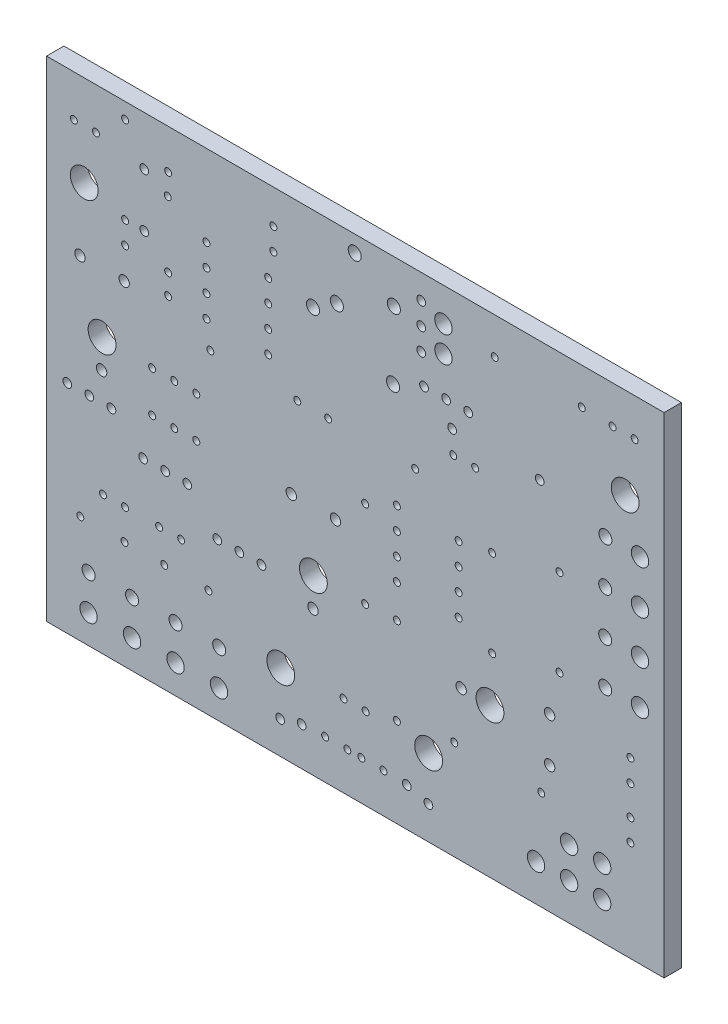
from build123d import *

# Parameters (mm, degrees)
ESQUISSE1_W             = 71
ESQUISSE1_H             = 56.3
EXTRUSION1_DEPTH        = 2
ESQUISSE3_R             = 0.50038
ESQUISSE3_R_2           = 0.39878
ESQUISSE3_R_3           = 1.6002
ESQUISSE3_R_4           = 0.59944
ESQUISSE3_R_5           = 0.7493
ESQUISSE3_R_6           = 1.00076
ENL_V_MAT_EXTRU_2_DEPTH = 91.634927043


with BuildPart() as part:
    # Esquisse1 → Extrusion1 (new body)
    with BuildSketch(Plane.XY):
        with Locations((35.5, -28.15)):
            Rectangle(ESQUISSE1_W, ESQUISSE1_H)
    extrude(amount=EXTRUSION1_DEPTH)

    # Esquisse3 → Enl_v. mat.-Extru.2 (cut, through all)
    with BuildSketch(Plane(origin=(0, 0, 0), x_dir=(-1, 0, 0), z_dir=(0, 0, -1))):
        with Locations((-46.632435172, -13.79982)):
            Circle(ESQUISSE3_R)
        with Locations((-56.695915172, -13.85062)):
            Circle(ESQUISSE3_R)
        with Locations((-26.081295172, -3.90144)):
            Circle(ESQUISSE3_R_2)
        with Locations((-26.081295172, -6.44144)):
            Circle(ESQUISSE3_R_2)
        with Locations((-65.080455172, -4.33324)):
            Circle(ESQUISSE3_R_2)
        with Locations((-67.620455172, -4.33324)):
            Circle(ESQUISSE3_R_2)
        with Locations((-5.682555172, -4.77012)):
            Circle(ESQUISSE3_R_2)
        with Locations((-3.142555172, -4.77012)):
            Circle(ESQUISSE3_R_2)
        with Locations((-4.331275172, -10.4521)):
            Circle(ESQUISSE3_R_3)
        with Locations((-25.481855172, -9.34974)):
            Circle(ESQUISSE3_R_2)
        with Locations((-40.282435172, -46.0502)):
            Circle(ESQUISSE3_R_2)
        with Locations((-40.282435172, -36.05022)):
            Circle(ESQUISSE3_R_2)
        with Locations((-36.632455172, -26.2509)):
            Circle(ESQUISSE3_R_2)
        with Locations((-36.632455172, -36.25088)):
            Circle(ESQUISSE3_R_2)
        with Locations((-61.532075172, -4.20116)):
            Circle(ESQUISSE3_R_2)
        with Locations((-51.532095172, -4.20116)):
            Circle(ESQUISSE3_R_2)
        with Locations((-46.881355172, -44.90212)):
            Circle(ESQUISSE3_R_2)
        with Locations((-56.881335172, -44.90212)):
            Circle(ESQUISSE3_R_2)
        with Locations((-28.832115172, -19.9009)):
            Circle(ESQUISSE3_R_2)
        with Locations((-18.832135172, -19.9009)):
            Circle(ESQUISSE3_R_2)
        with Locations((-58.981915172, -31.89986)):
            Circle(ESQUISSE3_R_2)
        with Locations((-58.981915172, -21.89988)):
            Circle(ESQUISSE3_R_2)
        with Locations((-51.232375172, -23.8506)):
            Circle(ESQUISSE3_R_2)
        with Locations((-51.232375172, -33.85058)):
            Circle(ESQUISSE3_R_2)
        with Locations((-32.383035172, -19.9009)):
            Circle(ESQUISSE3_R_2)
        with Locations((-42.383015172, -19.9009)):
            Circle(ESQUISSE3_R_2)
        with Locations((-43.932415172, -47.44974)):
            Circle(ESQUISSE3_R_3)
        with Locations((-13.983275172, -4.55168)):
            Circle(ESQUISSE3_R_2)
        with Locations((-13.983275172, -14.55166)):
            Circle(ESQUISSE3_R_2)
        with Locations((-36.683255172, -46.9011)):
            Circle(ESQUISSE3_R_2)
        with Locations((-34.143255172, -46.9011)):
            Circle(ESQUISSE3_R_2)
        with Locations((-38.735575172, -51.76774)):
            Circle(ESQUISSE3_R_2)
        with Locations((-66.533335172, -10.4521)):
            Circle(ESQUISSE3_R_3)
        with Locations((-11.232455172, -11.80084)):
            Circle(ESQUISSE3_R)
        with Locations((-57.841455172, -36.61156)):
            Circle(ESQUISSE3_R_4)
        with Locations((-57.841455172, -41.69156)):
            Circle(ESQUISSE3_R_4)
        with Locations((-47.671295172, -39.10076)):
            Circle(ESQUISSE3_R_4)
        with Locations((-3.843595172, -17.94002)):
            Circle(ESQUISSE3_R_4)
        with Locations((-8.923595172, -17.94002)):
            Circle(ESQUISSE3_R_4)
        with Locations((-6.332795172, -28.11018)):
            Circle(ESQUISSE3_R_4)
        with Locations((-19.632235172, -38.30066)):
            Circle(ESQUISSE3_R)
        with Locations((-22.172235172, -38.30066)):
            Circle(ESQUISSE3_R)
        with Locations((-24.712235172, -38.30066)):
            Circle(ESQUISSE3_R)
        with Locations((-11.232455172, -5.6515)):
            Circle(ESQUISSE3_R)
        with Locations((-50.983455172, -39.15156)):
            Circle(ESQUISSE3_R_3)
        with Locations((-6.383595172, -24.80056)):
            Circle(ESQUISSE3_R_3)
        with Locations((-64.254955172, -15.74038)):
            Circle(ESQUISSE3_R_5)
        with Locations((-64.232095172, -20.7518)):
            Circle(ESQUISSE3_R_5)
        with Locations((-64.232095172, -30.75178)):
            Circle(ESQUISSE3_R_5)
        with Locations((-64.232095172, -25.75052)):
            Circle(ESQUISSE3_R_5)
        with Locations((-26.932195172, -47.44974)):
            Circle(ESQUISSE3_R_3)
        with Locations((-68.232595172, -15.75054)):
            Circle(ESQUISSE3_R_6)
        with Locations((-68.232595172, -25.75052)):
            Circle(ESQUISSE3_R_6)
        with Locations((-68.232595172, -20.7518)):
            Circle(ESQUISSE3_R_6)
        with Locations((-68.232595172, -30.75178)):
            Circle(ESQUISSE3_R_6)
        with Locations((-60.081735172, -48.4505)):
            Circle(ESQUISSE3_R_6)
        with Locations((-63.881575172, -48.4505)):
            Circle(ESQUISSE3_R_6)
        with Locations((-32.032515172, -51.74996)):
            Circle(ESQUISSE3_R_2)
        with Locations((-34.582675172, -51.75758)):
            Circle(ESQUISSE3_R_2)
        with Locations((-36.195575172, -51.76774)):
            Circle(ESQUISSE3_R_2)
        with Locations((-13.983275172, -16.90116)):
            Circle(ESQUISSE3_R_2)
        with Locations((-13.932475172, -7.00024)):
            Circle(ESQUISSE3_R_2)
        with Locations((-6.482655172, -40.40124)):
            Circle(ESQUISSE3_R_2)
        with Locations((-9.022655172, -40.40124)):
            Circle(ESQUISSE3_R_2)
        with Locations((-19.853215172, -48.95088)):
            Circle(ESQUISSE3_R_5)
        with Locations((-12.141775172, -25.00122)):
            Circle(ESQUISSE3_R_2)
        with Locations((-14.681775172, -25.00122)):
            Circle(ESQUISSE3_R_2)
        with Locations((-17.221775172, -25.00122)):
            Circle(ESQUISSE3_R_2)
        with Locations((-16.182915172, -34.50082)):
            Circle(ESQUISSE3_R)
        with Locations((-13.642915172, -34.50082)):
            Circle(ESQUISSE3_R)
        with Locations((-11.102915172, -34.50082)):
            Circle(ESQUISSE3_R)
        with Locations((-14.831635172, -49.00168)):
            Circle(ESQUISSE3_R_5)
        with Locations((-4.831655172, -49.00168)):
            Circle(ESQUISSE3_R_5)
        with Locations((-9.832915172, -49.00168)):
            Circle(ESQUISSE3_R_5)
        with Locations((-19.832895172, -53.00218)):
            Circle(ESQUISSE3_R_6)
        with Locations((-9.832915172, -53.00218)):
            Circle(ESQUISSE3_R_6)
        with Locations((-14.831635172, -53.00218)):
            Circle(ESQUISSE3_R_6)
        with Locations((-4.831655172, -53.00218)):
            Circle(ESQUISSE3_R_6)
        with Locations((-15.481875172, -40.40124)):
            Circle(ESQUISSE3_R_2)
        with Locations((-12.941875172, -40.40124)):
            Circle(ESQUISSE3_R_2)
        with Locations((-3.881695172, -43.90136)):
            Circle(ESQUISSE3_R_2)
        with Locations((-8.961695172, -43.90136)):
            Circle(ESQUISSE3_R_2)
        with Locations((-13.533695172, -43.90136)):
            Circle(ESQUISSE3_R_2)
        with Locations((-18.613695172, -43.90136)):
            Circle(ESQUISSE3_R_2)
        with Locations((-67.132775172, -36.30168)):
            Circle(ESQUISSE3_R_2)
        with Locations((-67.132775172, -38.84168)):
            Circle(ESQUISSE3_R_2)
        with Locations((-67.132775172, -44.74972)):
            Circle(ESQUISSE3_R_2)
        with Locations((-67.132775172, -42.25036)):
            Circle(ESQUISSE3_R_2)
        with Locations((-26.863615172, -52.55768)):
            Circle(ESQUISSE3_R)
        with Locations((-29.335035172, -51.86934)):
            Circle(ESQUISSE3_R)
        with Locations((-41.422895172, -51.86934)):
            Circle(ESQUISSE3_R)
        with Locations((-43.907015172, -52.50942)):
            Circle(ESQUISSE3_R)
        with Locations((-63.881575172, -52.04968)):
            Circle(ESQUISSE3_R_6)
        with Locations((-60.081735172, -52.04968)):
            Circle(ESQUISSE3_R_6)
        with Locations((-56.281895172, -52.04968)):
            Circle(ESQUISSE3_R_6)
        with Locations((-35.433575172, -1.89992)):
            Circle(ESQUISSE3_R_5)
        with Locations((-39.931915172, -4.95046)):
            Circle(ESQUISSE3_R_5)
        with Locations((-39.832855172, -12.7508)):
            Circle(ESQUISSE3_R_5)
        with Locations((-30.632975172, -9.70026)):
            Circle(ESQUISSE3_R_5)
        with Locations((-33.381255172, -7.9502)):
            Circle(ESQUISSE3_R_5)
        with Locations((-9.032815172, -11.80084)):
            Circle(ESQUISSE3_R_2)
        with Locations((-9.032815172, -1.80086)):
            Circle(ESQUISSE3_R_2)
        with Locations((-9.032815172, -14.34084)):
            Circle(ESQUISSE3_R_2)
        with Locations((-17.221775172, -29.70022)):
            Circle(ESQUISSE3_R_2)
        with Locations((-14.681775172, -29.70022)):
            Circle(ESQUISSE3_R_2)
        with Locations((-12.141775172, -29.70022)):
            Circle(ESQUISSE3_R_2)
        with Locations((-2.383095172, -31.35122)):
            Circle(ESQUISSE3_R)
        with Locations((-4.923095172, -31.35122)):
            Circle(ESQUISSE3_R)
        with Locations((-7.463095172, -31.35122)):
            Circle(ESQUISSE3_R)
        with Locations((-28.141235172, -29.5402)):
            Circle(ESQUISSE3_R_4)
        with Locations((-33.221235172, -29.5402)):
            Circle(ESQUISSE3_R_4)
        with Locations((-30.632975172, -39.71036)):
            Circle(ESQUISSE3_R_4)
        with Locations((-30.681235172, -36.40074)):
            Circle(ESQUISSE3_R_3)
        with Locations((-47.381735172, -24.5999)):
            Circle(ESQUISSE3_R_2)
        with Locations((-47.381735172, -32.2199)):
            Circle(ESQUISSE3_R_2)
        with Locations((-47.381735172, -27.1399)):
            Circle(ESQUISSE3_R_2)
        with Locations((-47.381735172, -29.6799)):
            Circle(ESQUISSE3_R_2)
        with Locations((-40.282435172, -24.5999)):
            Circle(ESQUISSE3_R_2)
        with Locations((-40.282435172, -32.2199)):
            Circle(ESQUISSE3_R_2)
        with Locations((-40.282435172, -27.1399)):
            Circle(ESQUISSE3_R_2)
        with Locations((-40.282435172, -29.6799)):
            Circle(ESQUISSE3_R_2)
        with Locations((-25.481855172, -16.96974)):
            Circle(ESQUISSE3_R_2)
        with Locations((-25.481855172, -11.88974)):
            Circle(ESQUISSE3_R_2)
        with Locations((-25.481855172, -14.42974)):
            Circle(ESQUISSE3_R_2)
        with Locations((-18.382555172, -9.34974)):
            Circle(ESQUISSE3_R_2)
        with Locations((-18.382555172, -16.96974)):
            Circle(ESQUISSE3_R_2)
        with Locations((-18.382555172, -11.88974)):
            Circle(ESQUISSE3_R_2)
        with Locations((-18.382555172, -14.42974)):
            Circle(ESQUISSE3_R_2)
        with Locations((-48.481555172, -11.2014)):
            Circle(ESQUISSE3_R)
        with Locations((-43.401555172, -11.2014)):
            Circle(ESQUISSE3_R)
        with Locations((-45.941555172, -11.2014)):
            Circle(ESQUISSE3_R)
        with Locations((-43.081515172, -7.90194)):
            Circle(ESQUISSE3_R)
        with Locations((-43.081515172, -2.82194)):
            Circle(ESQUISSE3_R)
        with Locations((-43.081515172, -5.36194)):
            Circle(ESQUISSE3_R)
        with Locations((-45.631675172, -6.85038)):
            Circle(ESQUISSE3_R_6)
        with Locations((-49.281655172, -16.34998)):
            Circle(ESQUISSE3_R_2)
        with Locations((-46.761975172, -16.34998)):
            Circle(ESQUISSE3_R_2)
        with Locations((-45.631675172, -3.85064)):
            Circle(ESQUISSE3_R_6)
    extrude(amount=-ENL_V_MAT_EXTRU_2_DEPTH, mode=Mode.SUBTRACT)


solid = part.part
